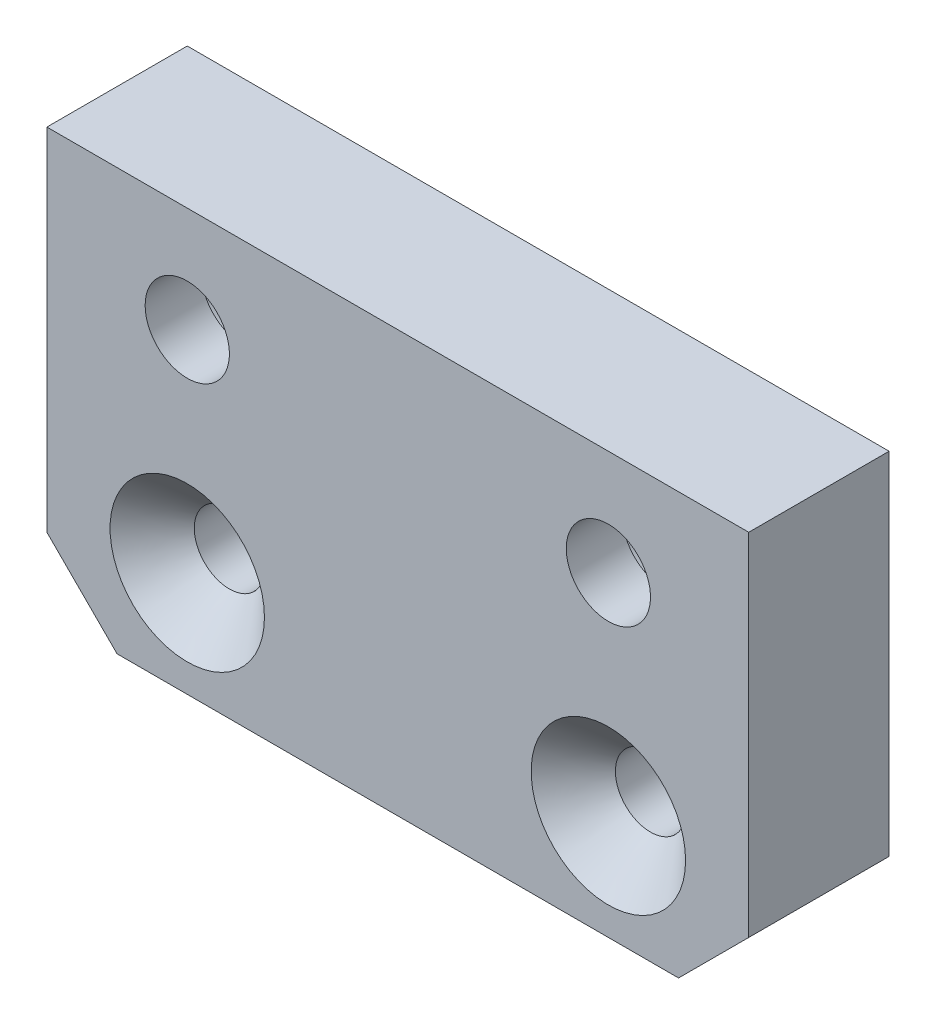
ISO-10303-21;
HEADER;
FILE_DESCRIPTION(('STEP AP214'),'2;1');
FILE_NAME('part.step','',(''),(''),'','','');
FILE_SCHEMA(('AUTOMOTIVE_DESIGN { 1 0 10303 214 1 1 1 1 }'));
ENDSEC;
DATA;
#1=APPLICATION_CONTEXT('core data for automotive mechanical design processes');
#2=APPLICATION_PROTOCOL_DEFINITION('international standard','automotive_design',2000,#1);
#3=PRODUCT_CONTEXT('',#1,'mechanical');
#4=PRODUCT('Part','Part','',(#3));
#5=PRODUCT_RELATED_PRODUCT_CATEGORY('part','',(#4));
#6=PRODUCT_DEFINITION_FORMATION('','',#4);
#7=PRODUCT_DEFINITION_CONTEXT('part definition',#1,'design');
#8=PRODUCT_DEFINITION('design','',#6,#7);
#9=PRODUCT_DEFINITION_SHAPE('','',#8);
#10=(LENGTH_UNIT() NAMED_UNIT(*) SI_UNIT(.MILLI.,.METRE.));
#11=(NAMED_UNIT(*) PLANE_ANGLE_UNIT() SI_UNIT($,.RADIAN.));
#12=(NAMED_UNIT(*) SI_UNIT($,.STERADIAN.) SOLID_ANGLE_UNIT());
#13=UNCERTAINTY_MEASURE_WITH_UNIT(LENGTH_MEASURE(1.E-05),#10,'distance_accuracy_value','');
#14=(GEOMETRIC_REPRESENTATION_CONTEXT(3) GLOBAL_UNCERTAINTY_ASSIGNED_CONTEXT((#13)) GLOBAL_UNIT_ASSIGNED_CONTEXT((#10,
#11,#12)) REPRESENTATION_CONTEXT('',''));
#15=CARTESIAN_POINT('',(0.,0.,0.));
#16=DIRECTION('',(0.,0.,1.));
#17=DIRECTION('',(1.,0.,0.));
#18=AXIS2_PLACEMENT_3D('',#15,#16,#17);
#19=CARTESIAN_POINT('',(-25.,30.,0.));
#20=DIRECTION('',(0.,0.,-1.));
#21=DIRECTION('',(-1.,0.,0.));
#22=AXIS2_PLACEMENT_3D('',#19,#20,#21);
#23=PLANE('',#22);
#24=CARTESIAN_POINT('',(15.,22.5,0.));
#25=DIRECTION('',(0.,0.,-1.));
#26=DIRECTION('',(-1.,0.,0.));
#27=AXIS2_PLACEMENT_3D('',#24,#25,#26);
#28=CIRCLE('',#27,5.49999999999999);
#29=CARTESIAN_POINT('',(9.50000000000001,22.5,0.));
#30=VERTEX_POINT('',#29);
#31=EDGE_CURVE('E158',#30,#30,#28,.T.);
#32=ORIENTED_EDGE('',*,*,#31,.F.);
#33=EDGE_LOOP('',(#32));
#34=FACE_BOUND('',#33,.T.);
#35=CARTESIAN_POINT('',(15.,7.5,6.59472476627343E-11));
#36=DIRECTION('',(0.,0.,1.));
#37=DIRECTION('',(1.,0.,0.));
#38=AXIS2_PLACEMENT_3D('',#35,#36,#37);
#39=CIRCLE('',#38,2.5);
#40=CARTESIAN_POINT('',(17.5,7.5,6.59473177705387E-11));
#41=VERTEX_POINT('',#40);
#42=EDGE_CURVE('E104',#41,#41,#39,.T.);
#43=ORIENTED_EDGE('',*,*,#42,.T.);
#44=EDGE_LOOP('',(#43));
#45=FACE_BOUND('',#44,.T.);
#46=DIRECTION('',(0.,1.,0.));
#47=VECTOR('',#46,1.);
#48=CARTESIAN_POINT('',(25.,0.,0.));
#49=LINE('',#48,#47);
#50=CARTESIAN_POINT('',(25.,5.00000000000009,0.));
#51=VERTEX_POINT('',#50);
#52=CARTESIAN_POINT('',(25.,30.,0.));
#53=VERTEX_POINT('',#52);
#54=EDGE_CURVE('E118',#51,#53,#49,.T.);
#55=ORIENTED_EDGE('',*,*,#54,.F.);
#56=DIRECTION('',(0.707106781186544,0.707106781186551,0.));
#57=VECTOR('',#56,1.);
#58=CARTESIAN_POINT('',(12.5000000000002,-7.49999999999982,0.));
#59=LINE('',#58,#57);
#60=CARTESIAN_POINT('',(20.,0.,0.));
#61=VERTEX_POINT('',#60);
#62=EDGE_CURVE('E123',#51,#61,#59,.F.);
#63=ORIENTED_EDGE('',*,*,#62,.T.);
#64=DIRECTION('',(1.,0.,0.));
#65=VECTOR('',#64,1.);
#66=CARTESIAN_POINT('',(-25.,0.,0.));
#67=LINE('',#66,#65);
#68=CARTESIAN_POINT('',(-19.9999999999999,0.,0.));
#69=VERTEX_POINT('',#68);
#70=EDGE_CURVE('E90',#69,#61,#67,.T.);
#71=ORIENTED_EDGE('',*,*,#70,.F.);
#72=DIRECTION('',(-0.707106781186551,0.707106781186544,0.));
#73=VECTOR('',#72,1.);
#74=CARTESIAN_POINT('',(-37.5,17.4999999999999,0.));
#75=LINE('',#74,#73);
#76=CARTESIAN_POINT('',(-25.,5.00000000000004,0.));
#77=VERTEX_POINT('',#76);
#78=EDGE_CURVE('E89',#69,#77,#75,.T.);
#79=ORIENTED_EDGE('',*,*,#78,.T.);
#80=DIRECTION('',(0.,1.,0.));
#81=VECTOR('',#80,1.);
#82=CARTESIAN_POINT('',(-25.,0.,0.));
#83=LINE('',#82,#81);
#84=CARTESIAN_POINT('',(-25.,30.,0.));
#85=VERTEX_POINT('',#84);
#86=EDGE_CURVE('E82',#77,#85,#83,.T.);
#87=ORIENTED_EDGE('',*,*,#86,.T.);
#88=DIRECTION('',(-1.,0.,0.));
#89=VECTOR('',#88,1.);
#90=CARTESIAN_POINT('',(25.,30.,0.));
#91=LINE('',#90,#89);
#92=EDGE_CURVE('E87',#53,#85,#91,.T.);
#93=ORIENTED_EDGE('',*,*,#92,.F.);
#94=EDGE_LOOP('',(#55,#63,#71,#79,#87,#93));
#95=FACE_BOUND('',#94,.T.);
#96=CARTESIAN_POINT('',(-15.,7.5,6.59472476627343E-11));
#97=DIRECTION('',(0.,0.,1.));
#98=DIRECTION('',(1.,0.,0.));
#99=AXIS2_PLACEMENT_3D('',#96,#97,#98);
#100=CIRCLE('',#99,2.5);
#101=CARTESIAN_POINT('',(-12.5,7.5,6.59473177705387E-11));
#102=VERTEX_POINT('',#101);
#103=EDGE_CURVE('E149',#102,#102,#100,.T.);
#104=ORIENTED_EDGE('',*,*,#103,.T.);
#105=EDGE_LOOP('',(#104));
#106=FACE_BOUND('',#105,.T.);
#107=CARTESIAN_POINT('',(-15.,22.5,0.));
#108=DIRECTION('',(0.,0.,-1.));
#109=DIRECTION('',(-1.,0.,0.));
#110=AXIS2_PLACEMENT_3D('',#107,#108,#109);
#111=CIRCLE('',#110,5.49999999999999);
#112=CARTESIAN_POINT('',(-20.5,22.5,0.));
#113=VERTEX_POINT('',#112);
#114=EDGE_CURVE('E170',#113,#113,#111,.T.);
#115=ORIENTED_EDGE('',*,*,#114,.F.);
#116=EDGE_LOOP('',(#115));
#117=FACE_BOUND('',#116,.T.);
#118=ADVANCED_FACE('F29',(#34,#45,#95,#106,#117),#23,.T.);
#119=CARTESIAN_POINT('',(-25.,30.,10.));
#120=DIRECTION('',(0.,0.,-1.));
#121=DIRECTION('',(-1.,0.,0.));
#122=AXIS2_PLACEMENT_3D('',#119,#120,#121);
#123=PLANE('',#122);
#124=CARTESIAN_POINT('',(-15.,22.5,10.));
#125=DIRECTION('',(0.,0.,-1.));
#126=DIRECTION('',(-1.,0.,0.));
#127=AXIS2_PLACEMENT_3D('',#124,#125,#126);
#128=CIRCLE('',#127,2.99999999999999);
#129=CARTESIAN_POINT('',(-18.,22.5,10.));
#130=VERTEX_POINT('',#129);
#131=EDGE_CURVE('E179',#130,#130,#128,.T.);
#132=ORIENTED_EDGE('',*,*,#131,.T.);
#133=EDGE_LOOP('',(#132));
#134=FACE_BOUND('',#133,.T.);
#135=CARTESIAN_POINT('',(15.,22.5,10.));
#136=DIRECTION('',(0.,0.,-1.));
#137=DIRECTION('',(-1.,0.,0.));
#138=AXIS2_PLACEMENT_3D('',#135,#136,#137);
#139=CIRCLE('',#138,2.99999999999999);
#140=CARTESIAN_POINT('',(12.,22.5,10.));
#141=VERTEX_POINT('',#140);
#142=EDGE_CURVE('E167',#141,#141,#139,.T.);
#143=ORIENTED_EDGE('',*,*,#142,.T.);
#144=EDGE_LOOP('',(#143));
#145=FACE_BOUND('',#144,.T.);
#146=CARTESIAN_POINT('',(15.,7.5,10.));
#147=DIRECTION('',(0.,0.,1.));
#148=DIRECTION('',(1.,0.,0.));
#149=AXIS2_PLACEMENT_3D('',#146,#147,#148);
#150=CIRCLE('',#149,5.5);
#151=CARTESIAN_POINT('',(20.5,7.5,10.));
#152=VERTEX_POINT('',#151);
#153=EDGE_CURVE('E146',#152,#152,#150,.T.);
#154=ORIENTED_EDGE('',*,*,#153,.F.);
#155=EDGE_LOOP('',(#154));
#156=FACE_BOUND('',#155,.T.);
#157=DIRECTION('',(1.,0.,0.));
#158=VECTOR('',#157,1.);
#159=CARTESIAN_POINT('',(-25.,0.,10.));
#160=LINE('',#159,#158);
#161=CARTESIAN_POINT('',(-19.9999999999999,0.,10.));
#162=VERTEX_POINT('',#161);
#163=CARTESIAN_POINT('',(20.,0.,10.));
#164=VERTEX_POINT('',#163);
#165=EDGE_CURVE('E113',#162,#164,#160,.T.);
#166=ORIENTED_EDGE('',*,*,#165,.T.);
#167=DIRECTION('',(-0.707106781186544,-0.707106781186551,0.));
#168=VECTOR('',#167,1.);
#169=CARTESIAN_POINT('',(25.,5.00000000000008,10.));
#170=LINE('',#169,#168);
#171=CARTESIAN_POINT('',(25.,5.00000000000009,10.));
#172=VERTEX_POINT('',#171);
#173=EDGE_CURVE('E37',#164,#172,#170,.F.);
#174=ORIENTED_EDGE('',*,*,#173,.T.);
#175=DIRECTION('',(0.,1.,0.));
#176=VECTOR('',#175,1.);
#177=CARTESIAN_POINT('',(25.,0.,10.));
#178=LINE('',#177,#176);
#179=CARTESIAN_POINT('',(25.,30.,10.));
#180=VERTEX_POINT('',#179);
#181=EDGE_CURVE('E111',#172,#180,#178,.T.);
#182=ORIENTED_EDGE('',*,*,#181,.T.);
#183=DIRECTION('',(-1.,0.,0.));
#184=VECTOR('',#183,1.);
#185=CARTESIAN_POINT('',(25.,30.,10.));
#186=LINE('',#185,#184);
#187=CARTESIAN_POINT('',(-25.,30.,10.));
#188=VERTEX_POINT('',#187);
#189=EDGE_CURVE('E116',#180,#188,#186,.T.);
#190=ORIENTED_EDGE('',*,*,#189,.T.);
#191=DIRECTION('',(0.,1.,0.));
#192=VECTOR('',#191,1.);
#193=CARTESIAN_POINT('',(-25.,0.,10.));
#194=LINE('',#193,#192);
#195=CARTESIAN_POINT('',(-25.,5.00000000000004,10.));
#196=VERTEX_POINT('',#195);
#197=EDGE_CURVE('E94',#196,#188,#194,.T.);
#198=ORIENTED_EDGE('',*,*,#197,.F.);
#199=DIRECTION('',(0.707106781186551,-0.707106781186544,0.));
#200=VECTOR('',#199,1.);
#201=CARTESIAN_POINT('',(-19.9999999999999,0.,10.));
#202=LINE('',#201,#200);
#203=EDGE_CURVE('E129',#196,#162,#202,.T.);
#204=ORIENTED_EDGE('',*,*,#203,.T.);
#205=EDGE_LOOP('',(#166,#174,#182,#190,#198,#204));
#206=FACE_BOUND('',#205,.T.);
#207=CARTESIAN_POINT('',(-15.,7.5,10.));
#208=DIRECTION('',(0.,0.,1.));
#209=DIRECTION('',(1.,0.,0.));
#210=AXIS2_PLACEMENT_3D('',#207,#208,#209);
#211=CIRCLE('',#210,5.5);
#212=CARTESIAN_POINT('',(-9.50000000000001,7.5,10.));
#213=VERTEX_POINT('',#212);
#214=EDGE_CURVE('E155',#213,#213,#211,.T.);
#215=ORIENTED_EDGE('',*,*,#214,.F.);
#216=EDGE_LOOP('',(#215));
#217=FACE_BOUND('',#216,.T.);
#218=ADVANCED_FACE('F133',(#134,#145,#156,#206,#217),#123,.F.);
#219=CARTESIAN_POINT('',(25.,30.,10.));
#220=DIRECTION('',(0.,-1.,0.));
#221=DIRECTION('',(0.,0.,-1.));
#222=AXIS2_PLACEMENT_3D('',#219,#220,#221);
#223=PLANE('',#222);
#224=DIRECTION('',(0.,0.,-1.));
#225=VECTOR('',#224,1.);
#226=CARTESIAN_POINT('',(-25.,30.,10.));
#227=LINE('',#226,#225);
#228=EDGE_CURVE('E93',#188,#85,#227,.T.);
#229=ORIENTED_EDGE('',*,*,#228,.F.);
#230=ORIENTED_EDGE('',*,*,#189,.F.);
#231=DIRECTION('',(0.,0.,-1.));
#232=VECTOR('',#231,1.);
#233=CARTESIAN_POINT('',(25.,30.,10.));
#234=LINE('',#233,#232);
#235=EDGE_CURVE('E99',#180,#53,#234,.T.);
#236=ORIENTED_EDGE('',*,*,#235,.T.);
#237=ORIENTED_EDGE('',*,*,#92,.T.);
#238=EDGE_LOOP('',(#229,#230,#236,#237));
#239=FACE_BOUND('',#238,.T.);
#240=ADVANCED_FACE('F102',(#239),#223,.F.);
#241=CARTESIAN_POINT('',(-25.,0.,10.));
#242=DIRECTION('',(-1.,0.,0.));
#243=DIRECTION('',(0.,0.,1.));
#244=AXIS2_PLACEMENT_3D('',#241,#242,#243);
#245=PLANE('',#244);
#246=ORIENTED_EDGE('',*,*,#86,.F.);
#247=DIRECTION('',(0.,0.,1.));
#248=VECTOR('',#247,1.);
#249=CARTESIAN_POINT('',(-25.,5.00000000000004,10.));
#250=LINE('',#249,#248);
#251=EDGE_CURVE('E11',#77,#196,#250,.T.);
#252=ORIENTED_EDGE('',*,*,#251,.T.);
#253=ORIENTED_EDGE('',*,*,#197,.T.);
#254=ORIENTED_EDGE('',*,*,#228,.T.);
#255=EDGE_LOOP('',(#246,#252,#253,#254));
#256=FACE_BOUND('',#255,.T.);
#257=ADVANCED_FACE('F31',(#256),#245,.T.);
#258=CARTESIAN_POINT('',(-25.,0.,10.));
#259=DIRECTION('',(0.,1.,0.));
#260=DIRECTION('',(0.,0.,1.));
#261=AXIS2_PLACEMENT_3D('',#258,#259,#260);
#262=PLANE('',#261);
#263=ORIENTED_EDGE('',*,*,#70,.T.);
#264=DIRECTION('',(0.,0.,1.));
#265=VECTOR('',#264,1.);
#266=CARTESIAN_POINT('',(20.,0.,10.));
#267=LINE('',#266,#265);
#268=EDGE_CURVE('E50',#61,#164,#267,.T.);
#269=ORIENTED_EDGE('',*,*,#268,.T.);
#270=ORIENTED_EDGE('',*,*,#165,.F.);
#271=DIRECTION('',(0.,0.,-1.));
#272=VECTOR('',#271,1.);
#273=CARTESIAN_POINT('',(-19.9999999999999,0.,0.));
#274=LINE('',#273,#272);
#275=EDGE_CURVE('E125',#162,#69,#274,.T.);
#276=ORIENTED_EDGE('',*,*,#275,.T.);
#277=EDGE_LOOP('',(#263,#269,#270,#276));
#278=FACE_BOUND('',#277,.T.);
#279=ADVANCED_FACE('F140',(#278),#262,.F.);
#280=CARTESIAN_POINT('',(25.,0.,10.));
#281=DIRECTION('',(-1.,0.,0.));
#282=DIRECTION('',(0.,0.,1.));
#283=AXIS2_PLACEMENT_3D('',#280,#281,#282);
#284=PLANE('',#283);
#285=ORIENTED_EDGE('',*,*,#181,.F.);
#286=DIRECTION('',(0.,0.,-1.));
#287=VECTOR('',#286,1.);
#288=CARTESIAN_POINT('',(25.,5.00000000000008,10.));
#289=LINE('',#288,#287);
#290=EDGE_CURVE('E98',#172,#51,#289,.T.);
#291=ORIENTED_EDGE('',*,*,#290,.T.);
#292=ORIENTED_EDGE('',*,*,#54,.T.);
#293=ORIENTED_EDGE('',*,*,#235,.F.);
#294=EDGE_LOOP('',(#285,#291,#292,#293));
#295=FACE_BOUND('',#294,.T.);
#296=ADVANCED_FACE('F138',(#295),#284,.F.);
#297=CARTESIAN_POINT('',(15.,7.5,10.));
#298=DIRECTION('',(0.,0.,1.));
#299=DIRECTION('',(1.,0.,0.));
#300=AXIS2_PLACEMENT_3D('',#297,#298,#299);
#301=CYLINDRICAL_SURFACE('',#300,2.5);
#302=CARTESIAN_POINT('',(15.,7.5,7.00000000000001));
#303=DIRECTION('',(0.,0.,1.));
#304=DIRECTION('',(1.,0.,0.));
#305=AXIS2_PLACEMENT_3D('',#302,#303,#304);
#306=CIRCLE('',#305,2.49999999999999);
#307=CARTESIAN_POINT('',(17.5,7.5,7.00000000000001));
#308=VERTEX_POINT('',#307);
#309=EDGE_CURVE('E107',#308,#308,#306,.T.);
#310=ORIENTED_EDGE('',*,*,#309,.T.);
#311=EDGE_LOOP('',(#310));
#312=FACE_BOUND('',#311,.T.);
#313=ORIENTED_EDGE('',*,*,#42,.F.);
#314=EDGE_LOOP('',(#313));
#315=FACE_BOUND('',#314,.T.);
#316=ADVANCED_FACE('F209',(#312,#315),#301,.F.);
#317=CARTESIAN_POINT('',(15.,7.5,7.00000000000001));
#318=DIRECTION('',(0.,0.,1.));
#319=DIRECTION('',(1.,0.,0.));
#320=AXIS2_PLACEMENT_3D('',#317,#318,#319);
#321=CONICAL_SURFACE('',#320,2.49999999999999,0.785398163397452);
#322=ORIENTED_EDGE('',*,*,#153,.T.);
#323=EDGE_LOOP('',(#322));
#324=FACE_BOUND('',#323,.T.);
#325=ORIENTED_EDGE('',*,*,#309,.F.);
#326=EDGE_LOOP('',(#325));
#327=FACE_BOUND('',#326,.T.);
#328=ADVANCED_FACE('F313',(#324,#327),#321,.F.);
#329=CARTESIAN_POINT('',(-15.,7.5,10.));
#330=DIRECTION('',(0.,0.,1.));
#331=DIRECTION('',(1.,0.,0.));
#332=AXIS2_PLACEMENT_3D('',#329,#330,#331);
#333=CYLINDRICAL_SURFACE('',#332,2.49999999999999);
#334=CARTESIAN_POINT('',(-15.,7.5,7.00000000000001));
#335=DIRECTION('',(0.,0.,1.));
#336=DIRECTION('',(1.,0.,0.));
#337=AXIS2_PLACEMENT_3D('',#334,#335,#336);
#338=CIRCLE('',#337,2.49999999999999);
#339=CARTESIAN_POINT('',(-12.5,7.5,7.00000000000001));
#340=VERTEX_POINT('',#339);
#341=EDGE_CURVE('E152',#340,#340,#338,.T.);
#342=ORIENTED_EDGE('',*,*,#341,.T.);
#343=EDGE_LOOP('',(#342));
#344=FACE_BOUND('',#343,.T.);
#345=ORIENTED_EDGE('',*,*,#103,.F.);
#346=EDGE_LOOP('',(#345));
#347=FACE_BOUND('',#346,.T.);
#348=ADVANCED_FACE('F305',(#344,#347),#333,.F.);
#349=CARTESIAN_POINT('',(-15.,7.5,7.00000000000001));
#350=DIRECTION('',(0.,0.,1.));
#351=DIRECTION('',(1.,0.,0.));
#352=AXIS2_PLACEMENT_3D('',#349,#350,#351);
#353=CONICAL_SURFACE('',#352,2.49999999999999,0.785398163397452);
#354=ORIENTED_EDGE('',*,*,#214,.T.);
#355=EDGE_LOOP('',(#354));
#356=FACE_BOUND('',#355,.T.);
#357=ORIENTED_EDGE('',*,*,#341,.F.);
#358=EDGE_LOOP('',(#357));
#359=FACE_BOUND('',#358,.T.);
#360=ADVANCED_FACE('F297',(#356,#359),#353,.F.);
#361=CARTESIAN_POINT('',(15.,22.5,0.));
#362=DIRECTION('',(0.,0.,-1.));
#363=DIRECTION('',(-1.,0.,0.));
#364=AXIS2_PLACEMENT_3D('',#361,#362,#363);
#365=CYLINDRICAL_SURFACE('',#364,5.49999999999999);
#366=ORIENTED_EDGE('',*,*,#31,.T.);
#367=EDGE_LOOP('',(#366));
#368=FACE_BOUND('',#367,.T.);
#369=CARTESIAN_POINT('',(15.,22.5,6.00000000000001));
#370=DIRECTION('',(0.,0.,-1.));
#371=DIRECTION('',(-1.,0.,0.));
#372=AXIS2_PLACEMENT_3D('',#369,#370,#371);
#373=CIRCLE('',#372,5.49999999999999);
#374=CARTESIAN_POINT('',(9.50000000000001,22.5,6.00000000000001));
#375=VERTEX_POINT('',#374);
#376=EDGE_CURVE('E161',#375,#375,#373,.T.);
#377=ORIENTED_EDGE('',*,*,#376,.F.);
#378=EDGE_LOOP('',(#377));
#379=FACE_BOUND('',#378,.T.);
#380=ADVANCED_FACE('F290',(#368,#379),#365,.F.);
#381=CARTESIAN_POINT('',(18.,22.5,6.00000000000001));
#382=DIRECTION('',(0.,0.,-1.));
#383=DIRECTION('',(-1.,0.,0.));
#384=AXIS2_PLACEMENT_3D('',#381,#382,#383);
#385=PLANE('',#384);
#386=ORIENTED_EDGE('',*,*,#376,.T.);
#387=EDGE_LOOP('',(#386));
#388=FACE_BOUND('',#387,.T.);
#389=CARTESIAN_POINT('',(15.,22.5,6.00000000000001));
#390=DIRECTION('',(0.,0.,-1.));
#391=DIRECTION('',(-1.,0.,0.));
#392=AXIS2_PLACEMENT_3D('',#389,#390,#391);
#393=CIRCLE('',#392,2.99999999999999);
#394=CARTESIAN_POINT('',(12.,22.5,6.00000000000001));
#395=VERTEX_POINT('',#394);
#396=EDGE_CURVE('E164',#395,#395,#393,.T.);
#397=ORIENTED_EDGE('',*,*,#396,.F.);
#398=EDGE_LOOP('',(#397));
#399=FACE_BOUND('',#398,.T.);
#400=ADVANCED_FACE('F283',(#388,#399),#385,.T.);
#401=CARTESIAN_POINT('',(15.,22.5,0.));
#402=DIRECTION('',(0.,0.,-1.));
#403=DIRECTION('',(-1.,0.,0.));
#404=AXIS2_PLACEMENT_3D('',#401,#402,#403);
#405=CYLINDRICAL_SURFACE('',#404,2.99999999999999);
#406=ORIENTED_EDGE('',*,*,#396,.T.);
#407=EDGE_LOOP('',(#406));
#408=FACE_BOUND('',#407,.T.);
#409=ORIENTED_EDGE('',*,*,#142,.F.);
#410=EDGE_LOOP('',(#409));
#411=FACE_BOUND('',#410,.T.);
#412=ADVANCED_FACE('F241',(#408,#411),#405,.F.);
#413=CARTESIAN_POINT('',(-15.,22.5,0.));
#414=DIRECTION('',(0.,0.,-1.));
#415=DIRECTION('',(-1.,0.,0.));
#416=AXIS2_PLACEMENT_3D('',#413,#414,#415);
#417=CYLINDRICAL_SURFACE('',#416,5.49999999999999);
#418=ORIENTED_EDGE('',*,*,#114,.T.);
#419=EDGE_LOOP('',(#418));
#420=FACE_BOUND('',#419,.T.);
#421=CARTESIAN_POINT('',(-15.,22.5,6.00000000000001));
#422=DIRECTION('',(0.,0.,-1.));
#423=DIRECTION('',(-1.,0.,0.));
#424=AXIS2_PLACEMENT_3D('',#421,#422,#423);
#425=CIRCLE('',#424,5.49999999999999);
#426=CARTESIAN_POINT('',(-20.5,22.5,6.00000000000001));
#427=VERTEX_POINT('',#426);
#428=EDGE_CURVE('E173',#427,#427,#425,.T.);
#429=ORIENTED_EDGE('',*,*,#428,.F.);
#430=EDGE_LOOP('',(#429));
#431=FACE_BOUND('',#430,.T.);
#432=ADVANCED_FACE('F196',(#420,#431),#417,.F.);
#433=CARTESIAN_POINT('',(-12.,22.5,6.00000000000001));
#434=DIRECTION('',(0.,0.,-1.));
#435=DIRECTION('',(-1.,0.,0.));
#436=AXIS2_PLACEMENT_3D('',#433,#434,#435);
#437=PLANE('',#436);
#438=ORIENTED_EDGE('',*,*,#428,.T.);
#439=EDGE_LOOP('',(#438));
#440=FACE_BOUND('',#439,.T.);
#441=CARTESIAN_POINT('',(-15.,22.5,6.00000000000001));
#442=DIRECTION('',(0.,0.,-1.));
#443=DIRECTION('',(-1.,0.,0.));
#444=AXIS2_PLACEMENT_3D('',#441,#442,#443);
#445=CIRCLE('',#444,2.99999999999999);
#446=CARTESIAN_POINT('',(-18.,22.5,6.00000000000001));
#447=VERTEX_POINT('',#446);
#448=EDGE_CURVE('E176',#447,#447,#445,.T.);
#449=ORIENTED_EDGE('',*,*,#448,.F.);
#450=EDGE_LOOP('',(#449));
#451=FACE_BOUND('',#450,.T.);
#452=ADVANCED_FACE('F187',(#440,#451),#437,.T.);
#453=CARTESIAN_POINT('',(-15.,22.5,0.));
#454=DIRECTION('',(0.,0.,-1.));
#455=DIRECTION('',(-1.,0.,0.));
#456=AXIS2_PLACEMENT_3D('',#453,#454,#455);
#457=CYLINDRICAL_SURFACE('',#456,2.99999999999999);
#458=ORIENTED_EDGE('',*,*,#448,.T.);
#459=EDGE_LOOP('',(#458));
#460=FACE_BOUND('',#459,.T.);
#461=ORIENTED_EDGE('',*,*,#131,.F.);
#462=EDGE_LOOP('',(#461));
#463=FACE_BOUND('',#462,.T.);
#464=ADVANCED_FACE('F185',(#460,#463),#457,.F.);
#465=CARTESIAN_POINT('',(25.,5.00000000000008,10.));
#466=DIRECTION('',(-0.707106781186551,0.707106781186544,0.));
#467=DIRECTION('',(-0.707106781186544,-0.707106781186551,0.));
#468=AXIS2_PLACEMENT_3D('',#465,#466,#467);
#469=PLANE('',#468);
#470=ORIENTED_EDGE('',*,*,#173,.F.);
#471=ORIENTED_EDGE('',*,*,#268,.F.);
#472=ORIENTED_EDGE('',*,*,#62,.F.);
#473=ORIENTED_EDGE('',*,*,#290,.F.);
#474=EDGE_LOOP('',(#470,#471,#472,#473));
#475=FACE_BOUND('',#474,.T.);
#476=ADVANCED_FACE('F139',(#475),#469,.F.);
#477=CARTESIAN_POINT('',(-19.9999999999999,0.,10.));
#478=DIRECTION('',(-0.707106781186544,-0.707106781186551,0.));
#479=DIRECTION('',(0.707106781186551,-0.707106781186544,0.));
#480=AXIS2_PLACEMENT_3D('',#477,#478,#479);
#481=PLANE('',#480);
#482=ORIENTED_EDGE('',*,*,#203,.F.);
#483=ORIENTED_EDGE('',*,*,#251,.F.);
#484=ORIENTED_EDGE('',*,*,#78,.F.);
#485=ORIENTED_EDGE('',*,*,#275,.F.);
#486=EDGE_LOOP('',(#482,#483,#484,#485));
#487=FACE_BOUND('',#486,.T.);
#488=ADVANCED_FACE('F194',(#487),#481,.T.);
#489=CLOSED_SHELL('',(#118,#218,#240,#257,#279,#296,#316,#328,#348,#360,#380,#400,#412,#432,
#452,#464,#476,#488));
#490=MANIFOLD_SOLID_BREP('B2',#489);
#491=ADVANCED_BREP_SHAPE_REPRESENTATION('',(#18,#490),#14);
#492=SHAPE_DEFINITION_REPRESENTATION(#9,#491);
ENDSEC;
END-ISO-10303-21;
